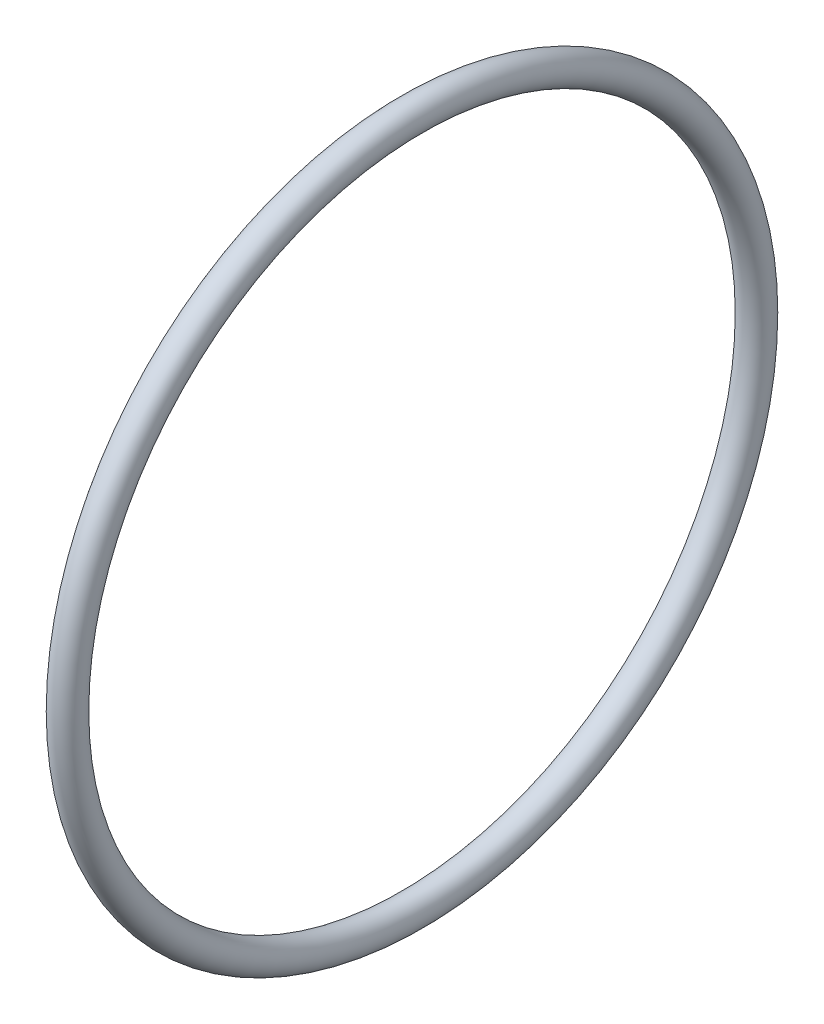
from build123d import *

# Parameters (mm, degrees)
ESQUISSE1_R = 3.495


with BuildPart() as part:
    # Esquisse1 → R_volution1 (revolve)
    with BuildSketch(Plane.XY, mode=Mode.PRIVATE) as r_volution1_sk:
        with Locations((-5.25260321, 74.846502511)):
            Circle(ESQUISSE1_R)
    revolve(r_volution1_sk.sketch.rotate(Axis((-29.236187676, -5.153497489, 0), (1, 0, 0)), 90), axis=Axis((-29.236187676, -5.153497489, 0), (1, 0, 0)))


solid = part.part
